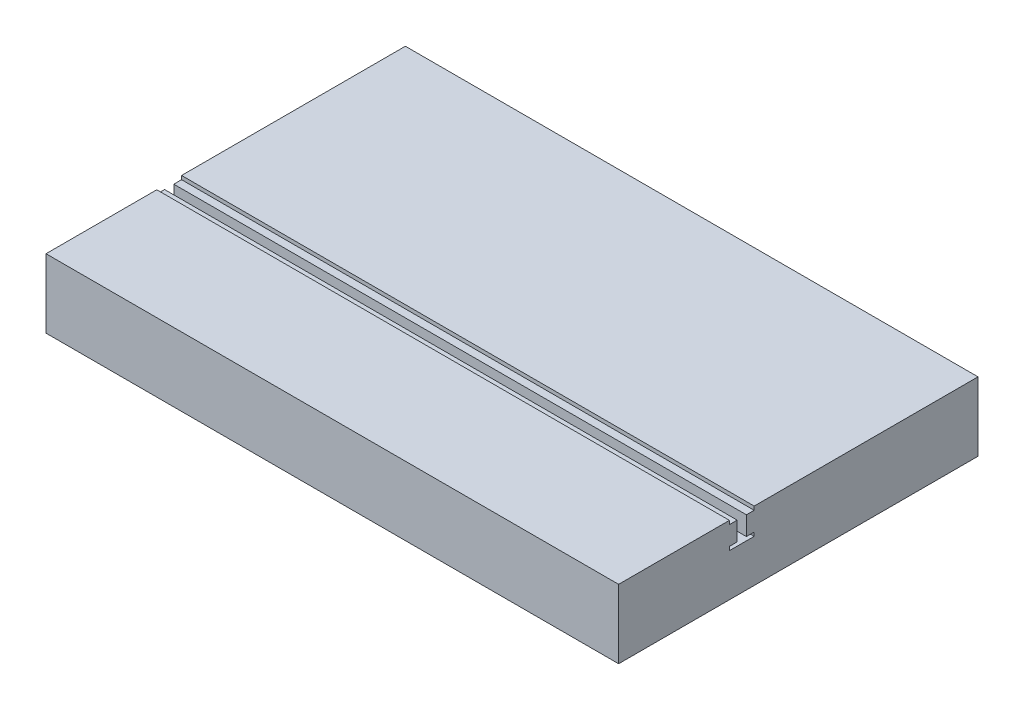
from build123d import *

# Parameters (mm, degrees)
SKETCH1_W          = 199.71583244
SKETCH1_H          = 125.342696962
EXTRUDE1_DEPTH     = 24
CUT_EXTRUDE1_DEPTH = 211.689609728


with BuildPart() as part:
    # Sketch1 → Extrude1 (new body)
    with BuildSketch(Plane(origin=(0, 0, 0), x_dir=(1, 0, 0), z_dir=(0, 1, 0))):
        Rectangle(SKETCH1_W, SKETCH1_H)
    extrude(amount=EXTRUDE1_DEPTH)

    # Sketch2 → Cut-Extrude1 (cut, through all)
    with BuildSketch(Plane(origin=(99.85791622, 0, 0), x_dir=(0, 0, -1), z_dir=(1, 0, 0))):
        Polygon((-24.033574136, 24), (-15.389481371, 24), (-15.389481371, 22.714983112), (-18.097298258, 22.714983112), (-18.097298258, 16.130710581), (-15.389481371, 16.130710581), (-15.389481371, 14.845693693), (-24.033574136, 14.845693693), (-24.033574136, 16.130710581), (-21.325757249, 16.130710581), (-21.325757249, 22.714983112), (-24.033574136, 22.714983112), align=None)
    extrude(amount=-CUT_EXTRUDE1_DEPTH, mode=Mode.SUBTRACT)


solid = part.part
